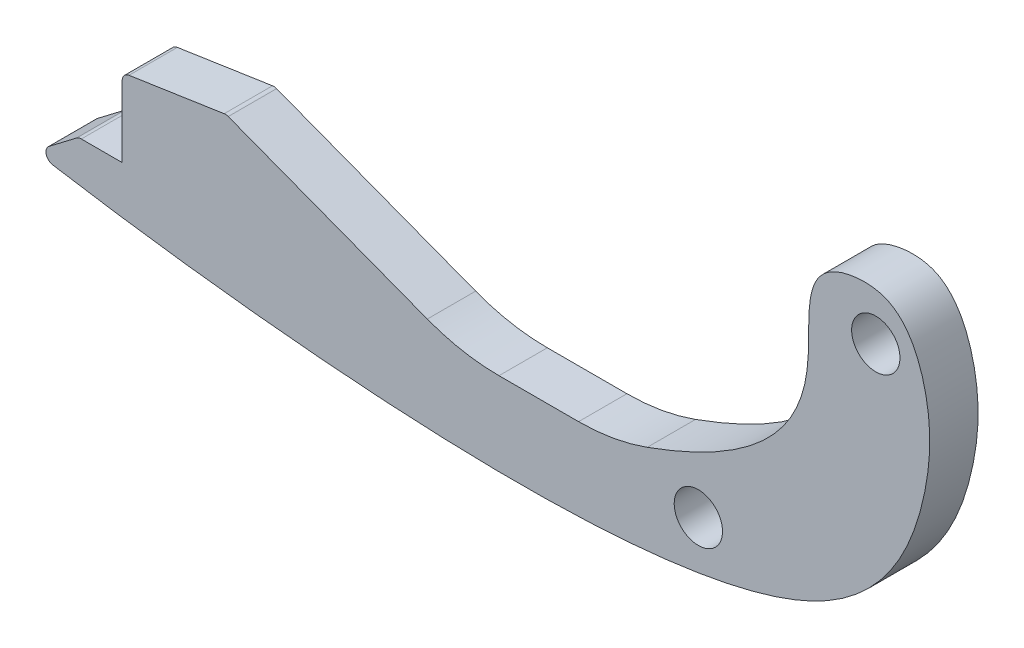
ISO-10303-21;
HEADER;
FILE_DESCRIPTION(('STEP AP214'),'2;1');
FILE_NAME('part.step','',(''),(''),'','','');
FILE_SCHEMA(('AUTOMOTIVE_DESIGN { 1 0 10303 214 1 1 1 1 }'));
ENDSEC;
DATA;
#1=APPLICATION_CONTEXT('core data for automotive mechanical design processes');
#2=APPLICATION_PROTOCOL_DEFINITION('international standard','automotive_design',2000,#1);
#3=PRODUCT_CONTEXT('',#1,'mechanical');
#4=PRODUCT('Part','Part','',(#3));
#5=PRODUCT_RELATED_PRODUCT_CATEGORY('part','',(#4));
#6=PRODUCT_DEFINITION_FORMATION('','',#4);
#7=PRODUCT_DEFINITION_CONTEXT('part definition',#1,'design');
#8=PRODUCT_DEFINITION('design','',#6,#7);
#9=PRODUCT_DEFINITION_SHAPE('','',#8);
#10=(LENGTH_UNIT() NAMED_UNIT(*) SI_UNIT(.MILLI.,.METRE.));
#11=(NAMED_UNIT(*) PLANE_ANGLE_UNIT() SI_UNIT($,.RADIAN.));
#12=(NAMED_UNIT(*) SI_UNIT($,.STERADIAN.) SOLID_ANGLE_UNIT());
#13=UNCERTAINTY_MEASURE_WITH_UNIT(LENGTH_MEASURE(1.E-05),#10,'distance_accuracy_value','');
#14=(GEOMETRIC_REPRESENTATION_CONTEXT(3) GLOBAL_UNCERTAINTY_ASSIGNED_CONTEXT((#13)) GLOBAL_UNIT_ASSIGNED_CONTEXT((#10,
#11,#12)) REPRESENTATION_CONTEXT('',''));
#15=CARTESIAN_POINT('',(0.,0.,0.));
#16=DIRECTION('',(0.,0.,1.));
#17=DIRECTION('',(1.,0.,0.));
#18=AXIS2_PLACEMENT_3D('',#15,#16,#17);
#19=CARTESIAN_POINT('',(22.6293093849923,18.4289926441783,3.048));
#20=DIRECTION('',(0.,0.,-1.));
#21=DIRECTION('',(-1.,0.,0.));
#22=AXIS2_PLACEMENT_3D('',#19,#20,#21);
#23=PLANE('',#22);
#24=CARTESIAN_POINT('',(20.2677876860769,27.5350231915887,3.048));
#25=DIRECTION('',(0.,0.,1.));
#26=DIRECTION('',(1.,0.,0.));
#27=AXIS2_PLACEMENT_3D('',#24,#25,#26);
#28=CIRCLE('',#27,1.524);
#29=CARTESIAN_POINT('',(18.7437876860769,27.5350231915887,3.048));
#30=VERTEX_POINT('',#29);
#31=EDGE_CURVE('E245',#30,#30,#28,.T.);
#32=ORIENTED_EDGE('',*,*,#31,.F.);
#33=EDGE_LOOP('',(#32));
#34=FACE_BOUND('',#33,.T.);
#35=DIRECTION('',(-1.,0.,0.));
#36=VECTOR('',#35,1.);
#37=CARTESIAN_POINT('',(-29.9965945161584,13.6816414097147,3.048));
#38=LINE('',#37,#36);
#39=CARTESIAN_POINT('',(-27.2482834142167,13.6816414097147,3.048));
#40=VERTEX_POINT('',#39);
#41=CARTESIAN_POINT('',(-29.8249537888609,13.6816414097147,3.048));
#42=VERTEX_POINT('',#41);
#43=EDGE_CURVE('E130',#40,#42,#38,.T.);
#44=ORIENTED_EDGE('',*,*,#43,.T.);
#45=CARTESIAN_POINT('',(-29.8249537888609,13.1736414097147,3.048));
#46=DIRECTION('',(0.,0.,-1.));
#47=DIRECTION('',(-1.,0.,0.));
#48=AXIS2_PLACEMENT_3D('',#45,#46,#47);
#49=CIRCLE('',#48,0.508);
#50=CARTESIAN_POINT('',(-30.1330617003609,13.5775393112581,3.048));
#51=VERTEX_POINT('',#50);
#52=EDGE_CURVE('E261',#42,#51,#49,.F.);
#53=ORIENTED_EDGE('',*,*,#52,.T.);
#54=DIRECTION('',(-0.795074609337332,-0.606511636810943,0.));
#55=VECTOR('',#54,1.);
#56=CARTESIAN_POINT('',(-32.7757503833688,11.5616009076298,3.048));
#57=LINE('',#56,#55);
#58=CARTESIAN_POINT('',(-31.8517395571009,12.2664697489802,3.048));
#59=VERTEX_POINT('',#58);
#60=EDGE_CURVE('E151',#51,#59,#57,.T.);
#61=ORIENTED_EDGE('',*,*,#60,.T.);
#62=CARTESIAN_POINT('',(-31.5436316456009,11.8625718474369,3.048));
#63=DIRECTION('',(0.,0.,-1.));
#64=DIRECTION('',(-1.,0.,0.));
#65=AXIS2_PLACEMENT_3D('',#62,#63,#64);
#66=CIRCLE('',#65,0.508);
#67=CARTESIAN_POINT('',(-31.6283933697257,11.3616931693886,3.048));
#68=VERTEX_POINT('',#67);
#69=EDGE_CURVE('E262',#59,#68,#66,.F.);
#70=ORIENTED_EDGE('',*,*,#69,.T.);
#71=CARTESIAN_POINT('',(-32.7757503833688,11.5616009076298,3.048));
#72=CARTESIAN_POINT('',(-25.7014626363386,10.2878145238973,3.048));
#73=CARTESIAN_POINT('',(15.6271652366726,4.09085473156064,3.048));
#74=CARTESIAN_POINT('',(23.4061715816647,18.7840539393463,3.048));
#75=CARTESIAN_POINT('',(23.9419978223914,25.9599764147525,3.048));
#76=CARTESIAN_POINT('',(21.9169974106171,30.8011403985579,3.048));
#77=CARTESIAN_POINT('',(15.308484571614,30.3570135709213,3.048));
#78=CARTESIAN_POINT('',(17.3819406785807,21.9915321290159,3.048));
#79=CARTESIAN_POINT('',(12.5367344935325,16.6791430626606,3.048));
#80=CARTESIAN_POINT('',(3.57592388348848,13.92379805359,3.048));
#81=B_SPLINE_CURVE_WITH_KNOTS('',3,(#71,#72,#73,#74,#75,#76,#77,#78,#79,#80),.UNSPECIFIED.,.F.,
.F.,(4,1,1,1,1,1,1,4),(0.,0.38975074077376,0.531750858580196,0.597670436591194,
0.657436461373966,0.68962853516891,0.80165392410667,1.),.UNSPECIFIED.);
#82=CARTESIAN_POINT('',(5.85357285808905,14.6829350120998,3.048));
#83=VERTEX_POINT('',#82);
#84=EDGE_CURVE('E146',#68,#83,#81,.T.);
#85=ORIENTED_EDGE('',*,*,#84,.T.);
#86=CARTESIAN_POINT('',(1.52855380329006,26.62379805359,3.048));
#87=DIRECTION('',(0.,0.,-1.));
#88=DIRECTION('',(-1.,0.,0.));
#89=AXIS2_PLACEMENT_3D('',#86,#87,#88);
#90=CIRCLE('',#89,12.7);
#91=CARTESIAN_POINT('',(1.52855380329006,13.92379805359,3.048));
#92=VERTEX_POINT('',#91);
#93=EDGE_CURVE('E309',#83,#92,#90,.T.);
#94=ORIENTED_EDGE('',*,*,#93,.T.);
#95=DIRECTION('',(-1.,0.,0.));
#96=VECTOR('',#95,1.);
#97=CARTESIAN_POINT('',(-5.82622704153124,13.92379805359,3.048));
#98=LINE('',#97,#96);
#99=CARTESIAN_POINT('',(-3.48886120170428,13.92379805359,3.048));
#100=VERTEX_POINT('',#99);
#101=EDGE_CURVE('E250',#92,#100,#98,.T.);
#102=ORIENTED_EDGE('',*,*,#101,.T.);
#103=CARTESIAN_POINT('',(-3.48886120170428,26.62379805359,3.048));
#104=DIRECTION('',(0.,0.,-1.));
#105=DIRECTION('',(-1.,0.,0.));
#106=AXIS2_PLACEMENT_3D('',#103,#104,#105);
#107=CIRCLE('',#106,12.7);
#108=CARTESIAN_POINT('',(-8.01043629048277,14.7559693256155,3.048));
#109=VERTEX_POINT('',#108);
#110=EDGE_CURVE('E306',#100,#109,#107,.T.);
#111=ORIENTED_EDGE('',*,*,#110,.T.);
#112=DIRECTION('',(-0.934474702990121,0.356029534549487,0.));
#113=VECTOR('',#112,1.);
#114=CARTESIAN_POINT('',(-20.6855257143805,19.5851061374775,3.048));
#115=LINE('',#114,#113);
#116=CARTESIAN_POINT('',(-20.5609374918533,19.537638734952,3.048));
#117=VERTEX_POINT('',#116);
#118=EDGE_CURVE('E253',#109,#117,#115,.T.);
#119=ORIENTED_EDGE('',*,*,#118,.T.);
#120=CARTESIAN_POINT('',(-20.7418004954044,19.062925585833,3.048));
#121=DIRECTION('',(0.,0.,-1.));
#122=DIRECTION('',(-1.,0.,0.));
#123=AXIS2_PLACEMENT_3D('',#120,#121,#122);
#124=CIRCLE('',#123,0.508);
#125=CARTESIAN_POINT('',(-20.8173667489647,19.5652738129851,3.048));
#126=VERTEX_POINT('',#125);
#127=EDGE_CURVE('E257',#117,#126,#124,.F.);
#128=ORIENTED_EDGE('',*,*,#127,.T.);
#129=DIRECTION('',(-0.988874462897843,-0.148752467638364,0.));
#130=VECTOR('',#129,1.);
#131=CARTESIAN_POINT('',(-27.2482834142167,18.5978964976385,3.048));
#132=LINE('',#131,#130);
#133=CARTESIAN_POINT('',(-26.815849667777,18.662945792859,3.048));
#134=VERTEX_POINT('',#133);
#135=EDGE_CURVE('E135',#126,#134,#132,.T.);
#136=ORIENTED_EDGE('',*,*,#135,.T.);
#137=CARTESIAN_POINT('',(-26.7402834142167,18.1605975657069,3.048));
#138=DIRECTION('',(0.,0.,-1.));
#139=DIRECTION('',(-1.,0.,0.));
#140=AXIS2_PLACEMENT_3D('',#137,#138,#139);
#141=CIRCLE('',#140,0.508);
#142=CARTESIAN_POINT('',(-27.2482834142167,18.1605975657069,3.048));
#143=VERTEX_POINT('',#142);
#144=EDGE_CURVE('E47',#134,#143,#141,.F.);
#145=ORIENTED_EDGE('',*,*,#144,.T.);
#146=DIRECTION('',(0.,-1.,0.));
#147=VECTOR('',#146,1.);
#148=CARTESIAN_POINT('',(-27.2482834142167,13.6816414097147,3.048));
#149=LINE('',#148,#147);
#150=EDGE_CURVE('E126',#143,#40,#149,.T.);
#151=ORIENTED_EDGE('',*,*,#150,.T.);
#152=EDGE_LOOP('',(#44,#53,#61,#70,#85,#94,#102,#111,#119,#128,#136,#145,#151));
#153=FACE_BOUND('',#152,.T.);
#154=CARTESIAN_POINT('',(9.08037325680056,12.4623363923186,3.048));
#155=DIRECTION('',(0.,0.,1.));
#156=DIRECTION('',(1.,0.,0.));
#157=AXIS2_PLACEMENT_3D('',#154,#155,#156);
#158=CIRCLE('',#157,1.524);
#159=CARTESIAN_POINT('',(7.55637325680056,12.4623363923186,3.048));
#160=VERTEX_POINT('',#159);
#161=EDGE_CURVE('E236',#160,#160,#158,.T.);
#162=ORIENTED_EDGE('',*,*,#161,.F.);
#163=EDGE_LOOP('',(#162));
#164=FACE_BOUND('',#163,.T.);
#165=ADVANCED_FACE('F32',(#34,#153,#164),#23,.F.);
#166=CARTESIAN_POINT('',(22.6293093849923,18.4289926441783,0.));
#167=DIRECTION('',(0.,0.,-1.));
#168=DIRECTION('',(-1.,0.,0.));
#169=AXIS2_PLACEMENT_3D('',#166,#167,#168);
#170=PLANE('',#169);
#171=CARTESIAN_POINT('',(20.2677876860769,27.5350231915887,0.));
#172=DIRECTION('',(0.,0.,1.));
#173=DIRECTION('',(1.,0.,0.));
#174=AXIS2_PLACEMENT_3D('',#171,#172,#173);
#175=CIRCLE('',#174,1.524);
#176=CARTESIAN_POINT('',(18.7437876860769,27.5350231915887,0.));
#177=VERTEX_POINT('',#176);
#178=EDGE_CURVE('E242',#177,#177,#175,.T.);
#179=ORIENTED_EDGE('',*,*,#178,.T.);
#180=EDGE_LOOP('',(#179));
#181=FACE_BOUND('',#180,.T.);
#182=DIRECTION('',(-0.795074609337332,-0.606511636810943,0.));
#183=VECTOR('',#182,1.);
#184=CARTESIAN_POINT('',(-32.7757503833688,11.5616009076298,0.));
#185=LINE('',#184,#183);
#186=CARTESIAN_POINT('',(-30.1330617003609,13.5775393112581,0.));
#187=VERTEX_POINT('',#186);
#188=CARTESIAN_POINT('',(-31.8517395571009,12.2664697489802,0.));
#189=VERTEX_POINT('',#188);
#190=EDGE_CURVE('E284',#187,#189,#185,.T.);
#191=ORIENTED_EDGE('',*,*,#190,.F.);
#192=CARTESIAN_POINT('',(-29.8249537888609,13.1736414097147,0.));
#193=DIRECTION('',(0.,0.,-1.));
#194=DIRECTION('',(-1.,0.,0.));
#195=AXIS2_PLACEMENT_3D('',#192,#193,#194);
#196=CIRCLE('',#195,0.508);
#197=CARTESIAN_POINT('',(-29.8249537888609,13.6816414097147,0.));
#198=VERTEX_POINT('',#197);
#199=EDGE_CURVE('E321',#187,#198,#196,.T.);
#200=ORIENTED_EDGE('',*,*,#199,.T.);
#201=DIRECTION('',(-1.,0.,0.));
#202=VECTOR('',#201,1.);
#203=CARTESIAN_POINT('',(-29.9965945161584,13.6816414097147,0.));
#204=LINE('',#203,#202);
#205=CARTESIAN_POINT('',(-27.2482834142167,13.6816414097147,0.));
#206=VERTEX_POINT('',#205);
#207=EDGE_CURVE('E286',#206,#198,#204,.T.);
#208=ORIENTED_EDGE('',*,*,#207,.F.);
#209=DIRECTION('',(0.,-1.,0.));
#210=VECTOR('',#209,1.);
#211=CARTESIAN_POINT('',(-27.2482834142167,13.6816414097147,0.));
#212=LINE('',#211,#210);
#213=CARTESIAN_POINT('',(-27.2482834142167,18.1605975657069,0.));
#214=VERTEX_POINT('',#213);
#215=EDGE_CURVE('E141',#214,#206,#212,.T.);
#216=ORIENTED_EDGE('',*,*,#215,.F.);
#217=CARTESIAN_POINT('',(-26.7402834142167,18.1605975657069,0.));
#218=DIRECTION('',(0.,0.,-1.));
#219=DIRECTION('',(-1.,0.,0.));
#220=AXIS2_PLACEMENT_3D('',#217,#218,#219);
#221=CIRCLE('',#220,0.508);
#222=CARTESIAN_POINT('',(-26.815849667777,18.662945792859,0.));
#223=VERTEX_POINT('',#222);
#224=EDGE_CURVE('E319',#214,#223,#221,.T.);
#225=ORIENTED_EDGE('',*,*,#224,.T.);
#226=DIRECTION('',(-0.988874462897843,-0.148752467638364,0.));
#227=VECTOR('',#226,1.);
#228=CARTESIAN_POINT('',(-27.2482834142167,18.5978964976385,0.));
#229=LINE('',#228,#227);
#230=CARTESIAN_POINT('',(-20.8173667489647,19.5652738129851,0.));
#231=VERTEX_POINT('',#230);
#232=EDGE_CURVE('E334',#231,#223,#229,.T.);
#233=ORIENTED_EDGE('',*,*,#232,.F.);
#234=CARTESIAN_POINT('',(-20.7418004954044,19.062925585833,0.));
#235=DIRECTION('',(0.,0.,-1.));
#236=DIRECTION('',(-1.,0.,0.));
#237=AXIS2_PLACEMENT_3D('',#234,#235,#236);
#238=CIRCLE('',#237,0.508);
#239=CARTESIAN_POINT('',(-20.5609374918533,19.537638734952,0.));
#240=VERTEX_POINT('',#239);
#241=EDGE_CURVE('E316',#231,#240,#238,.T.);
#242=ORIENTED_EDGE('',*,*,#241,.T.);
#243=DIRECTION('',(-0.934474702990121,0.356029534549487,0.));
#244=VECTOR('',#243,1.);
#245=CARTESIAN_POINT('',(-20.6855257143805,19.5851061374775,0.));
#246=LINE('',#245,#244);
#247=CARTESIAN_POINT('',(-8.01043629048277,14.7559693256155,0.));
#248=VERTEX_POINT('',#247);
#249=EDGE_CURVE('E332',#248,#240,#246,.T.);
#250=ORIENTED_EDGE('',*,*,#249,.F.);
#251=CARTESIAN_POINT('',(-3.48886120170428,26.62379805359,0.));
#252=DIRECTION('',(0.,0.,-1.));
#253=DIRECTION('',(-1.,0.,0.));
#254=AXIS2_PLACEMENT_3D('',#251,#252,#253);
#255=CIRCLE('',#254,12.7);
#256=CARTESIAN_POINT('',(-3.48886120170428,13.92379805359,0.));
#257=VERTEX_POINT('',#256);
#258=EDGE_CURVE('E304',#248,#257,#255,.F.);
#259=ORIENTED_EDGE('',*,*,#258,.T.);
#260=DIRECTION('',(-1.,0.,0.));
#261=VECTOR('',#260,1.);
#262=CARTESIAN_POINT('',(-5.82622704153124,13.92379805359,0.));
#263=LINE('',#262,#261);
#264=CARTESIAN_POINT('',(1.52855380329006,13.92379805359,0.));
#265=VERTEX_POINT('',#264);
#266=EDGE_CURVE('E161',#265,#257,#263,.T.);
#267=ORIENTED_EDGE('',*,*,#266,.F.);
#268=CARTESIAN_POINT('',(1.52855380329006,26.62379805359,0.));
#269=DIRECTION('',(0.,0.,-1.));
#270=DIRECTION('',(-1.,0.,0.));
#271=AXIS2_PLACEMENT_3D('',#268,#269,#270);
#272=CIRCLE('',#271,12.7);
#273=CARTESIAN_POINT('',(5.85357285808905,14.6829350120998,0.));
#274=VERTEX_POINT('',#273);
#275=EDGE_CURVE('E282',#265,#274,#272,.F.);
#276=ORIENTED_EDGE('',*,*,#275,.T.);
#277=CARTESIAN_POINT('',(-32.7757503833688,11.5616009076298,0.));
#278=CARTESIAN_POINT('',(-25.7014626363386,10.2878145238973,0.));
#279=CARTESIAN_POINT('',(15.6271652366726,4.09085473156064,0.));
#280=CARTESIAN_POINT('',(23.4061715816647,18.7840539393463,0.));
#281=CARTESIAN_POINT('',(23.9419978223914,25.9599764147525,0.));
#282=CARTESIAN_POINT('',(21.9169974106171,30.8011403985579,0.));
#283=CARTESIAN_POINT('',(15.308484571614,30.3570135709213,0.));
#284=CARTESIAN_POINT('',(17.3819406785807,21.9915321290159,0.));
#285=CARTESIAN_POINT('',(12.5367344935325,16.6791430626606,0.));
#286=CARTESIAN_POINT('',(3.57592388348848,13.92379805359,0.));
#287=B_SPLINE_CURVE_WITH_KNOTS('',3,(#277,#278,#279,#280,#281,#282,#283,#284,#285,#286),
.UNSPECIFIED.,.F.,.F.,(4,1,1,1,1,1,1,4),(0.,0.38975074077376,0.531750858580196,
0.597670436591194,0.657436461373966,0.68962853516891,0.80165392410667,1.),.UNSPECIFIED.);
#288=CARTESIAN_POINT('',(-31.6283933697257,11.3616931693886,0.));
#289=VERTEX_POINT('',#288);
#290=EDGE_CURVE('E254',#289,#274,#287,.T.);
#291=ORIENTED_EDGE('',*,*,#290,.F.);
#292=CARTESIAN_POINT('',(-31.5436316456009,11.8625718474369,0.));
#293=DIRECTION('',(0.,0.,-1.));
#294=DIRECTION('',(-1.,0.,0.));
#295=AXIS2_PLACEMENT_3D('',#292,#293,#294);
#296=CIRCLE('',#295,0.508);
#297=EDGE_CURVE('E279',#289,#189,#296,.T.);
#298=ORIENTED_EDGE('',*,*,#297,.T.);
#299=EDGE_LOOP('',(#191,#200,#208,#216,#225,#233,#242,#250,#259,#267,#276,#291,#298));
#300=FACE_BOUND('',#299,.T.);
#301=CARTESIAN_POINT('',(9.08037325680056,12.4623363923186,0.));
#302=DIRECTION('',(0.,0.,1.));
#303=DIRECTION('',(1.,0.,0.));
#304=AXIS2_PLACEMENT_3D('',#301,#302,#303);
#305=CIRCLE('',#304,1.524);
#306=CARTESIAN_POINT('',(7.55637325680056,12.4623363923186,0.));
#307=VERTEX_POINT('',#306);
#308=EDGE_CURVE('E239',#307,#307,#305,.T.);
#309=ORIENTED_EDGE('',*,*,#308,.T.);
#310=EDGE_LOOP('',(#309));
#311=FACE_BOUND('',#310,.T.);
#312=ADVANCED_FACE('F174',(#181,#300,#311),#170,.T.);
#313=CARTESIAN_POINT('',(-5.82622704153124,13.92379805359,3.048));
#314=DIRECTION('',(0.,-1.,0.));
#315=DIRECTION('',(0.,0.,-1.));
#316=AXIS2_PLACEMENT_3D('',#313,#314,#315);
#317=PLANE('',#316);
#318=ORIENTED_EDGE('',*,*,#266,.T.);
#319=DIRECTION('',(0.,0.,-1.));
#320=VECTOR('',#319,1.);
#321=CARTESIAN_POINT('',(-3.48886120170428,13.92379805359,3.048));
#322=LINE('',#321,#320);
#323=EDGE_CURVE('E300',#257,#100,#322,.F.);
#324=ORIENTED_EDGE('',*,*,#323,.T.);
#325=ORIENTED_EDGE('',*,*,#101,.F.);
#326=DIRECTION('',(0.,0.,1.));
#327=VECTOR('',#326,1.);
#328=CARTESIAN_POINT('',(1.52855380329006,13.92379805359,0.));
#329=LINE('',#328,#327);
#330=EDGE_CURVE('E297',#92,#265,#329,.F.);
#331=ORIENTED_EDGE('',*,*,#330,.T.);
#332=EDGE_LOOP('',(#318,#324,#325,#331));
#333=FACE_BOUND('',#332,.T.);
#334=ADVANCED_FACE('F189',(#333),#317,.F.);
#335=CARTESIAN_POINT('',(-20.6855257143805,19.5851061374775,3.048));
#336=DIRECTION('',(-0.356029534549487,-0.934474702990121,0.));
#337=DIRECTION('',(0.934474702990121,-0.356029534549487,0.));
#338=AXIS2_PLACEMENT_3D('',#335,#336,#337);
#339=PLANE('',#338);
#340=ORIENTED_EDGE('',*,*,#249,.T.);
#341=DIRECTION('',(0.,0.,-1.));
#342=VECTOR('',#341,1.);
#343=CARTESIAN_POINT('',(-20.5609374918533,19.537638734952,3.048));
#344=LINE('',#343,#342);
#345=EDGE_CURVE('E11',#240,#117,#344,.F.);
#346=ORIENTED_EDGE('',*,*,#345,.T.);
#347=ORIENTED_EDGE('',*,*,#118,.F.);
#348=DIRECTION('',(0.,0.,-1.));
#349=VECTOR('',#348,1.);
#350=CARTESIAN_POINT('',(-8.01043629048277,14.7559693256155,0.));
#351=LINE('',#350,#349);
#352=EDGE_CURVE('E145',#109,#248,#351,.T.);
#353=ORIENTED_EDGE('',*,*,#352,.T.);
#354=EDGE_LOOP('',(#340,#346,#347,#353));
#355=FACE_BOUND('',#354,.T.);
#356=ADVANCED_FACE('F186',(#355),#339,.F.);
#357=CARTESIAN_POINT('',(-27.2482834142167,18.5978964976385,3.048));
#358=DIRECTION('',(0.148752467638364,-0.988874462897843,0.));
#359=DIRECTION('',(0.988874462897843,0.148752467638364,0.));
#360=AXIS2_PLACEMENT_3D('',#357,#358,#359);
#361=PLANE('',#360);
#362=ORIENTED_EDGE('',*,*,#232,.T.);
#363=DIRECTION('',(0.,0.,-1.));
#364=VECTOR('',#363,1.);
#365=CARTESIAN_POINT('',(-26.815849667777,18.662945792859,3.048));
#366=LINE('',#365,#364);
#367=EDGE_CURVE('E55',#223,#134,#366,.F.);
#368=ORIENTED_EDGE('',*,*,#367,.T.);
#369=ORIENTED_EDGE('',*,*,#135,.F.);
#370=DIRECTION('',(0.,0.,-1.));
#371=VECTOR('',#370,1.);
#372=CARTESIAN_POINT('',(-20.8173667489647,19.5652738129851,3.048));
#373=LINE('',#372,#371);
#374=EDGE_CURVE('E269',#126,#231,#373,.T.);
#375=ORIENTED_EDGE('',*,*,#374,.T.);
#376=EDGE_LOOP('',(#362,#368,#369,#375));
#377=FACE_BOUND('',#376,.T.);
#378=ADVANCED_FACE('F183',(#377),#361,.F.);
#379=CARTESIAN_POINT('',(-27.2482834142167,13.6816414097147,3.048));
#380=DIRECTION('',(1.,0.,0.));
#381=DIRECTION('',(0.,0.,-1.));
#382=AXIS2_PLACEMENT_3D('',#379,#380,#381);
#383=PLANE('',#382);
#384=ORIENTED_EDGE('',*,*,#150,.F.);
#385=DIRECTION('',(0.,0.,-1.));
#386=VECTOR('',#385,1.);
#387=CARTESIAN_POINT('',(-27.2482834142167,18.1605975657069,3.048));
#388=LINE('',#387,#386);
#389=EDGE_CURVE('E260',#143,#214,#388,.T.);
#390=ORIENTED_EDGE('',*,*,#389,.T.);
#391=ORIENTED_EDGE('',*,*,#215,.T.);
#392=DIRECTION('',(0.,0.,-1.));
#393=VECTOR('',#392,1.);
#394=CARTESIAN_POINT('',(-27.2482834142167,13.6816414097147,3.048));
#395=LINE('',#394,#393);
#396=EDGE_CURVE('E138',#40,#206,#395,.T.);
#397=ORIENTED_EDGE('',*,*,#396,.F.);
#398=EDGE_LOOP('',(#384,#390,#391,#397));
#399=FACE_BOUND('',#398,.T.);
#400=ADVANCED_FACE('F139',(#399),#383,.F.);
#401=CARTESIAN_POINT('',(-29.9965945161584,13.6816414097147,3.048));
#402=DIRECTION('',(0.,-1.,0.));
#403=DIRECTION('',(0.,0.,-1.));
#404=AXIS2_PLACEMENT_3D('',#401,#402,#403);
#405=PLANE('',#404);
#406=ORIENTED_EDGE('',*,*,#207,.T.);
#407=DIRECTION('',(0.,0.,-1.));
#408=VECTOR('',#407,1.);
#409=CARTESIAN_POINT('',(-29.8249537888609,13.6816414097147,3.048));
#410=LINE('',#409,#408);
#411=EDGE_CURVE('E150',#198,#42,#410,.F.);
#412=ORIENTED_EDGE('',*,*,#411,.T.);
#413=ORIENTED_EDGE('',*,*,#43,.F.);
#414=ORIENTED_EDGE('',*,*,#396,.T.);
#415=EDGE_LOOP('',(#406,#412,#413,#414));
#416=FACE_BOUND('',#415,.T.);
#417=ADVANCED_FACE('F148',(#416),#405,.F.);
#418=CARTESIAN_POINT('',(-32.7757503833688,11.5616009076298,3.048));
#419=DIRECTION('',(0.606511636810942,-0.795074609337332,0.));
#420=DIRECTION('',(0.795074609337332,0.606511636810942,0.));
#421=AXIS2_PLACEMENT_3D('',#418,#419,#420);
#422=PLANE('',#421);
#423=ORIENTED_EDGE('',*,*,#60,.F.);
#424=DIRECTION('',(0.,0.,-1.));
#425=VECTOR('',#424,1.);
#426=CARTESIAN_POINT('',(-30.1330617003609,13.5775393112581,3.048));
#427=LINE('',#426,#425);
#428=EDGE_CURVE('E313',#51,#187,#427,.T.);
#429=ORIENTED_EDGE('',*,*,#428,.T.);
#430=ORIENTED_EDGE('',*,*,#190,.T.);
#431=DIRECTION('',(0.,0.,-1.));
#432=VECTOR('',#431,1.);
#433=CARTESIAN_POINT('',(-31.8517395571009,12.2664697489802,3.048));
#434=LINE('',#433,#432);
#435=EDGE_CURVE('E311',#189,#59,#434,.F.);
#436=ORIENTED_EDGE('',*,*,#435,.T.);
#437=EDGE_LOOP('',(#423,#429,#430,#436));
#438=FACE_BOUND('',#437,.T.);
#439=ADVANCED_FACE('F172',(#438),#422,.F.);
#440=DIRECTION('',(0.,0.,-1.));
#441=VECTOR('',#440,1.);
#442=SURFACE_OF_LINEAR_EXTRUSION('',#81,#441);
#443=ORIENTED_EDGE('',*,*,#84,.F.);
#444=DIRECTION('',(0.,0.,-1.));
#445=VECTOR('',#444,1.);
#446=CARTESIAN_POINT('',(-31.6283933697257,11.3616931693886,3.048));
#447=LINE('',#446,#445);
#448=EDGE_CURVE('E40',#68,#289,#447,.T.);
#449=ORIENTED_EDGE('',*,*,#448,.T.);
#450=ORIENTED_EDGE('',*,*,#290,.T.);
#451=DIRECTION('',(0.,0.,-1.));
#452=VECTOR('',#451,1.);
#453=CARTESIAN_POINT('',(5.85357285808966,14.6829350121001,0.));
#454=LINE('',#453,#452);
#455=EDGE_CURVE('E302',#274,#83,#454,.F.);
#456=ORIENTED_EDGE('',*,*,#455,.T.);
#457=EDGE_LOOP('',(#443,#449,#450,#456));
#458=FACE_BOUND('',#457,.T.);
#459=ADVANCED_FACE('F167',(#458),#442,.F.);
#460=CARTESIAN_POINT('',(20.2677876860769,27.5350231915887,3.048));
#461=DIRECTION('',(0.,0.,-1.));
#462=DIRECTION('',(-1.,0.,0.));
#463=AXIS2_PLACEMENT_3D('',#460,#461,#462);
#464=CYLINDRICAL_SURFACE('',#463,1.524);
#465=CARTESIAN_POINT('',(18.7437876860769,27.5350231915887,3.048));
#466=CARTESIAN_POINT('',(18.7437876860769,27.5350231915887,3.01625));
#467=CARTESIAN_POINT('',(18.7437876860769,27.5350231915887,2.9845));
#468=CARTESIAN_POINT('',(18.7437876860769,27.5350231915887,2.921));
#469=CARTESIAN_POINT('',(18.7437876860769,27.5350231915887,2.88925));
#470=CARTESIAN_POINT('',(18.7437876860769,27.5350231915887,2.82575));
#471=CARTESIAN_POINT('',(18.7437876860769,27.5350231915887,2.794));
#472=CARTESIAN_POINT('',(18.7437876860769,27.5350231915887,2.7305));
#473=CARTESIAN_POINT('',(18.7437876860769,27.5350231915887,2.69875));
#474=CARTESIAN_POINT('',(18.7437876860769,27.5350231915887,2.63525));
#475=CARTESIAN_POINT('',(18.7437876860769,27.5350231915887,2.6035));
#476=CARTESIAN_POINT('',(18.7437876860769,27.5350231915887,2.54));
#477=CARTESIAN_POINT('',(18.7437876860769,27.5350231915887,2.50825));
#478=CARTESIAN_POINT('',(18.7437876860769,27.5350231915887,2.44475));
#479=CARTESIAN_POINT('',(18.7437876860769,27.5350231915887,2.413));
#480=CARTESIAN_POINT('',(18.7437876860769,27.5350231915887,2.3495));
#481=CARTESIAN_POINT('',(18.7437876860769,27.5350231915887,2.31775));
#482=CARTESIAN_POINT('',(18.7437876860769,27.5350231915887,2.25425));
#483=CARTESIAN_POINT('',(18.7437876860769,27.5350231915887,2.2225));
#484=CARTESIAN_POINT('',(18.7437876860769,27.5350231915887,2.159));
#485=CARTESIAN_POINT('',(18.7437876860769,27.5350231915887,2.12725));
#486=CARTESIAN_POINT('',(18.7437876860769,27.5350231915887,2.06375));
#487=CARTESIAN_POINT('',(18.7437876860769,27.5350231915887,2.032));
#488=CARTESIAN_POINT('',(18.7437876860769,27.5350231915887,1.9685));
#489=CARTESIAN_POINT('',(18.7437876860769,27.5350231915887,1.93675));
#490=CARTESIAN_POINT('',(18.7437876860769,27.5350231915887,1.87325));
#491=CARTESIAN_POINT('',(18.7437876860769,27.5350231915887,1.8415));
#492=CARTESIAN_POINT('',(18.7437876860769,27.5350231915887,1.778));
#493=CARTESIAN_POINT('',(18.7437876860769,27.5350231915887,1.74625));
#494=CARTESIAN_POINT('',(18.7437876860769,27.5350231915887,1.68275));
#495=CARTESIAN_POINT('',(18.7437876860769,27.5350231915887,1.651));
#496=CARTESIAN_POINT('',(18.7437876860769,27.5350231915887,1.5875));
#497=CARTESIAN_POINT('',(18.7437876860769,27.5350231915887,1.55575));
#498=CARTESIAN_POINT('',(18.7437876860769,27.5350231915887,1.49225));
#499=CARTESIAN_POINT('',(18.7437876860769,27.5350231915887,1.4605));
#500=CARTESIAN_POINT('',(18.7437876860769,27.5350231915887,1.397));
#501=CARTESIAN_POINT('',(18.7437876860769,27.5350231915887,1.36525));
#502=CARTESIAN_POINT('',(18.7437876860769,27.5350231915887,1.30175));
#503=CARTESIAN_POINT('',(18.7437876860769,27.5350231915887,1.27));
#504=CARTESIAN_POINT('',(18.7437876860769,27.5350231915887,1.2065));
#505=CARTESIAN_POINT('',(18.7437876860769,27.5350231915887,1.17475));
#506=CARTESIAN_POINT('',(18.7437876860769,27.5350231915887,1.11125));
#507=CARTESIAN_POINT('',(18.7437876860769,27.5350231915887,1.0795));
#508=CARTESIAN_POINT('',(18.7437876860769,27.5350231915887,1.016));
#509=CARTESIAN_POINT('',(18.7437876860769,27.5350231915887,0.98425));
#510=CARTESIAN_POINT('',(18.7437876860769,27.5350231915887,0.92075));
#511=CARTESIAN_POINT('',(18.7437876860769,27.5350231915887,0.889));
#512=CARTESIAN_POINT('',(18.7437876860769,27.5350231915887,0.8255));
#513=CARTESIAN_POINT('',(18.7437876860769,27.5350231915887,0.79375));
#514=CARTESIAN_POINT('',(18.7437876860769,27.5350231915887,0.73025));
#515=CARTESIAN_POINT('',(18.7437876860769,27.5350231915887,0.6985));
#516=CARTESIAN_POINT('',(18.7437876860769,27.5350231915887,0.635));
#517=CARTESIAN_POINT('',(18.7437876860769,27.5350231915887,0.60325));
#518=CARTESIAN_POINT('',(18.7437876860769,27.5350231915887,0.53975));
#519=CARTESIAN_POINT('',(18.7437876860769,27.5350231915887,0.508));
#520=CARTESIAN_POINT('',(18.7437876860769,27.5350231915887,0.4445));
#521=CARTESIAN_POINT('',(18.7437876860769,27.5350231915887,0.41275));
#522=CARTESIAN_POINT('',(18.7437876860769,27.5350231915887,0.34925));
#523=CARTESIAN_POINT('',(18.7437876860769,27.5350231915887,0.3175));
#524=CARTESIAN_POINT('',(18.7437876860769,27.5350231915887,0.254));
#525=CARTESIAN_POINT('',(18.7437876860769,27.5350231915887,0.22225));
#526=CARTESIAN_POINT('',(18.7437876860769,27.5350231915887,0.15875));
#527=CARTESIAN_POINT('',(18.7437876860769,27.5350231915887,0.127));
#528=CARTESIAN_POINT('',(18.7437876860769,27.5350231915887,0.0634999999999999));
#529=CARTESIAN_POINT('',(18.7437876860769,27.5350231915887,0.03175));
#530=CARTESIAN_POINT('',(18.7437876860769,27.5350231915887,0.));
#531=B_SPLINE_CURVE_WITH_KNOTS('',3,(#465,#466,#467,#468,#469,#470,#471,#472,#473,#474,#475,
#476,#477,#478,#479,#480,#481,#482,#483,#484,#485,#486,#487,#488,#489,#490,#491,#492,#493,#494,
#495,#496,#497,#498,#499,#500,#501,#502,#503,#504,#505,#506,#507,#508,#509,#510,#511,#512,#513,
#514,#515,#516,#517,#518,#519,#520,#521,#522,#523,#524,#525,#526,#527,#528,#529,#530),
.UNSPECIFIED.,.F.,.F.,(4,2,2,2,2,2,2,2,2,2,2,2,2,2,2,2,2,2,2,2,2,2,2,2,2,2,2,2,2,2,2,2,4),(0.,
0.0952499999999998,0.1905,0.28575,0.381,0.47625,0.5715,0.66675,0.762,0.85725,0.9525,1.04775,
1.143,1.23825,1.3335,1.42875,1.524,1.61925,1.7145,1.80975,1.905,2.00025,2.0955,2.19075,2.286,
2.38125,2.4765,2.57175,2.667,2.76225,2.8575,2.95275,3.048),.UNSPECIFIED.);
#532=EDGE_CURVE('BSEAM171',#30,#177,#531,.T.);
#533=ORIENTED_EDGE('',*,*,#31,.T.);
#534=ORIENTED_EDGE('',*,*,#178,.F.);
#535=ORIENTED_EDGE('',*,*,#532,.T.);
#536=ORIENTED_EDGE('',*,*,#532,.F.);
#537=EDGE_LOOP('',(#533,#535,#534,#536));
#538=FACE_BOUND('',#537,.T.);
#539=ADVANCED_FACE('F171',(#538),#464,.F.);
#540=CARTESIAN_POINT('',(9.08037325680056,12.4623363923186,3.048));
#541=DIRECTION('',(0.,0.,-1.));
#542=DIRECTION('',(-1.,0.,0.));
#543=AXIS2_PLACEMENT_3D('',#540,#541,#542);
#544=CYLINDRICAL_SURFACE('',#543,1.524);
#545=CARTESIAN_POINT('',(7.55637325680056,12.4623363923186,3.048));
#546=CARTESIAN_POINT('',(7.55637325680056,12.4623363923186,3.01625));
#547=CARTESIAN_POINT('',(7.55637325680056,12.4623363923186,2.9845));
#548=CARTESIAN_POINT('',(7.55637325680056,12.4623363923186,2.921));
#549=CARTESIAN_POINT('',(7.55637325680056,12.4623363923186,2.88925));
#550=CARTESIAN_POINT('',(7.55637325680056,12.4623363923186,2.82575));
#551=CARTESIAN_POINT('',(7.55637325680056,12.4623363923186,2.794));
#552=CARTESIAN_POINT('',(7.55637325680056,12.4623363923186,2.7305));
#553=CARTESIAN_POINT('',(7.55637325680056,12.4623363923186,2.69875));
#554=CARTESIAN_POINT('',(7.55637325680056,12.4623363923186,2.63525));
#555=CARTESIAN_POINT('',(7.55637325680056,12.4623363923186,2.6035));
#556=CARTESIAN_POINT('',(7.55637325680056,12.4623363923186,2.54));
#557=CARTESIAN_POINT('',(7.55637325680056,12.4623363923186,2.50825));
#558=CARTESIAN_POINT('',(7.55637325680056,12.4623363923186,2.44475));
#559=CARTESIAN_POINT('',(7.55637325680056,12.4623363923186,2.413));
#560=CARTESIAN_POINT('',(7.55637325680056,12.4623363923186,2.3495));
#561=CARTESIAN_POINT('',(7.55637325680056,12.4623363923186,2.31775));
#562=CARTESIAN_POINT('',(7.55637325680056,12.4623363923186,2.25425));
#563=CARTESIAN_POINT('',(7.55637325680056,12.4623363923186,2.2225));
#564=CARTESIAN_POINT('',(7.55637325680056,12.4623363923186,2.159));
#565=CARTESIAN_POINT('',(7.55637325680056,12.4623363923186,2.12725));
#566=CARTESIAN_POINT('',(7.55637325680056,12.4623363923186,2.06375));
#567=CARTESIAN_POINT('',(7.55637325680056,12.4623363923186,2.032));
#568=CARTESIAN_POINT('',(7.55637325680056,12.4623363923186,1.9685));
#569=CARTESIAN_POINT('',(7.55637325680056,12.4623363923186,1.93675));
#570=CARTESIAN_POINT('',(7.55637325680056,12.4623363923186,1.87325));
#571=CARTESIAN_POINT('',(7.55637325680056,12.4623363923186,1.8415));
#572=CARTESIAN_POINT('',(7.55637325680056,12.4623363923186,1.778));
#573=CARTESIAN_POINT('',(7.55637325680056,12.4623363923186,1.74625));
#574=CARTESIAN_POINT('',(7.55637325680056,12.4623363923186,1.68275));
#575=CARTESIAN_POINT('',(7.55637325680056,12.4623363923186,1.651));
#576=CARTESIAN_POINT('',(7.55637325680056,12.4623363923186,1.5875));
#577=CARTESIAN_POINT('',(7.55637325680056,12.4623363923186,1.55575));
#578=CARTESIAN_POINT('',(7.55637325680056,12.4623363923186,1.49225));
#579=CARTESIAN_POINT('',(7.55637325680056,12.4623363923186,1.4605));
#580=CARTESIAN_POINT('',(7.55637325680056,12.4623363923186,1.397));
#581=CARTESIAN_POINT('',(7.55637325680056,12.4623363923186,1.36525));
#582=CARTESIAN_POINT('',(7.55637325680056,12.4623363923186,1.30175));
#583=CARTESIAN_POINT('',(7.55637325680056,12.4623363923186,1.27));
#584=CARTESIAN_POINT('',(7.55637325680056,12.4623363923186,1.2065));
#585=CARTESIAN_POINT('',(7.55637325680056,12.4623363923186,1.17475));
#586=CARTESIAN_POINT('',(7.55637325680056,12.4623363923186,1.11125));
#587=CARTESIAN_POINT('',(7.55637325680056,12.4623363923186,1.0795));
#588=CARTESIAN_POINT('',(7.55637325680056,12.4623363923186,1.016));
#589=CARTESIAN_POINT('',(7.55637325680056,12.4623363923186,0.98425));
#590=CARTESIAN_POINT('',(7.55637325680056,12.4623363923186,0.92075));
#591=CARTESIAN_POINT('',(7.55637325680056,12.4623363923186,0.889));
#592=CARTESIAN_POINT('',(7.55637325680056,12.4623363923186,0.8255));
#593=CARTESIAN_POINT('',(7.55637325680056,12.4623363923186,0.79375));
#594=CARTESIAN_POINT('',(7.55637325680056,12.4623363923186,0.73025));
#595=CARTESIAN_POINT('',(7.55637325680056,12.4623363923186,0.6985));
#596=CARTESIAN_POINT('',(7.55637325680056,12.4623363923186,0.635));
#597=CARTESIAN_POINT('',(7.55637325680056,12.4623363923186,0.60325));
#598=CARTESIAN_POINT('',(7.55637325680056,12.4623363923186,0.53975));
#599=CARTESIAN_POINT('',(7.55637325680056,12.4623363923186,0.508));
#600=CARTESIAN_POINT('',(7.55637325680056,12.4623363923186,0.4445));
#601=CARTESIAN_POINT('',(7.55637325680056,12.4623363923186,0.41275));
#602=CARTESIAN_POINT('',(7.55637325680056,12.4623363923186,0.34925));
#603=CARTESIAN_POINT('',(7.55637325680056,12.4623363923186,0.3175));
#604=CARTESIAN_POINT('',(7.55637325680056,12.4623363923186,0.254));
#605=CARTESIAN_POINT('',(7.55637325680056,12.4623363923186,0.22225));
#606=CARTESIAN_POINT('',(7.55637325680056,12.4623363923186,0.15875));
#607=CARTESIAN_POINT('',(7.55637325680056,12.4623363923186,0.127));
#608=CARTESIAN_POINT('',(7.55637325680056,12.4623363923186,0.0634999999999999));
#609=CARTESIAN_POINT('',(7.55637325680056,12.4623363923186,0.03175));
#610=CARTESIAN_POINT('',(7.55637325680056,12.4623363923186,0.));
#611=B_SPLINE_CURVE_WITH_KNOTS('',3,(#545,#546,#547,#548,#549,#550,#551,#552,#553,#554,#555,
#556,#557,#558,#559,#560,#561,#562,#563,#564,#565,#566,#567,#568,#569,#570,#571,#572,#573,#574,
#575,#576,#577,#578,#579,#580,#581,#582,#583,#584,#585,#586,#587,#588,#589,#590,#591,#592,#593,
#594,#595,#596,#597,#598,#599,#600,#601,#602,#603,#604,#605,#606,#607,#608,#609,#610),
.UNSPECIFIED.,.F.,.F.,(4,2,2,2,2,2,2,2,2,2,2,2,2,2,2,2,2,2,2,2,2,2,2,2,2,2,2,2,2,2,2,2,4),(0.,
0.0952499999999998,0.1905,0.28575,0.381,0.47625,0.5715,0.66675,0.762,0.85725,0.9525,1.04775,
1.143,1.23825,1.3335,1.42875,1.524,1.61925,1.7145,1.80975,1.905,2.00025,2.0955,2.19075,2.286,
2.38125,2.4765,2.57175,2.667,2.76225,2.8575,2.95275,3.048),.UNSPECIFIED.);
#612=EDGE_CURVE('BSEAM198',#160,#307,#611,.T.);
#613=ORIENTED_EDGE('',*,*,#161,.T.);
#614=ORIENTED_EDGE('',*,*,#308,.F.);
#615=ORIENTED_EDGE('',*,*,#612,.T.);
#616=ORIENTED_EDGE('',*,*,#612,.F.);
#617=EDGE_LOOP('',(#613,#615,#614,#616));
#618=FACE_BOUND('',#617,.T.);
#619=ADVANCED_FACE('F198',(#618),#544,.F.);
#620=CARTESIAN_POINT('',(-3.48886120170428,26.62379805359,3.048));
#621=DIRECTION('',(0.,0.,1.));
#622=DIRECTION('',(1.,0.,0.));
#623=AXIS2_PLACEMENT_3D('',#620,#621,#622);
#624=CYLINDRICAL_SURFACE('',#623,12.7);
#625=ORIENTED_EDGE('',*,*,#110,.F.);
#626=ORIENTED_EDGE('',*,*,#323,.F.);
#627=ORIENTED_EDGE('',*,*,#258,.F.);
#628=ORIENTED_EDGE('',*,*,#352,.F.);
#629=EDGE_LOOP('',(#625,#626,#627,#628));
#630=FACE_BOUND('',#629,.T.);
#631=ADVANCED_FACE('F194',(#630),#624,.F.);
#632=CARTESIAN_POINT('',(1.52855380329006,26.62379805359,1.524));
#633=DIRECTION('',(0.,0.,-1.));
#634=DIRECTION('',(-1.,0.,0.));
#635=AXIS2_PLACEMENT_3D('',#632,#633,#634);
#636=CYLINDRICAL_SURFACE('',#635,12.7);
#637=ORIENTED_EDGE('',*,*,#93,.F.);
#638=ORIENTED_EDGE('',*,*,#455,.F.);
#639=ORIENTED_EDGE('',*,*,#275,.F.);
#640=ORIENTED_EDGE('',*,*,#330,.F.);
#641=EDGE_LOOP('',(#637,#638,#639,#640));
#642=FACE_BOUND('',#641,.T.);
#643=ADVANCED_FACE('F197',(#642),#636,.F.);
#644=CARTESIAN_POINT('',(-29.8249537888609,13.1736414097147,3.048));
#645=DIRECTION('',(0.,0.,-1.));
#646=DIRECTION('',(-1.,0.,0.));
#647=AXIS2_PLACEMENT_3D('',#644,#645,#646);
#648=CYLINDRICAL_SURFACE('',#647,0.508);
#649=ORIENTED_EDGE('',*,*,#52,.F.);
#650=ORIENTED_EDGE('',*,*,#411,.F.);
#651=ORIENTED_EDGE('',*,*,#199,.F.);
#652=ORIENTED_EDGE('',*,*,#428,.F.);
#653=EDGE_LOOP('',(#649,#650,#651,#652));
#654=FACE_BOUND('',#653,.T.);
#655=ADVANCED_FACE('F202',(#654),#648,.T.);
#656=CARTESIAN_POINT('',(-26.7402834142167,18.1605975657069,3.048));
#657=DIRECTION('',(0.,0.,-1.));
#658=DIRECTION('',(-1.,0.,0.));
#659=AXIS2_PLACEMENT_3D('',#656,#657,#658);
#660=CYLINDRICAL_SURFACE('',#659,0.508);
#661=ORIENTED_EDGE('',*,*,#144,.F.);
#662=ORIENTED_EDGE('',*,*,#367,.F.);
#663=ORIENTED_EDGE('',*,*,#224,.F.);
#664=ORIENTED_EDGE('',*,*,#389,.F.);
#665=EDGE_LOOP('',(#661,#662,#663,#664));
#666=FACE_BOUND('',#665,.T.);
#667=ADVANCED_FACE('F206',(#666),#660,.T.);
#668=CARTESIAN_POINT('',(-31.5436316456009,11.8625718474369,1.524));
#669=DIRECTION('',(0.,0.,-1.));
#670=DIRECTION('',(-1.,0.,0.));
#671=AXIS2_PLACEMENT_3D('',#668,#669,#670);
#672=CYLINDRICAL_SURFACE('',#671,0.508);
#673=ORIENTED_EDGE('',*,*,#69,.F.);
#674=ORIENTED_EDGE('',*,*,#435,.F.);
#675=ORIENTED_EDGE('',*,*,#297,.F.);
#676=ORIENTED_EDGE('',*,*,#448,.F.);
#677=EDGE_LOOP('',(#673,#674,#675,#676));
#678=FACE_BOUND('',#677,.T.);
#679=ADVANCED_FACE('F209',(#678),#672,.T.);
#680=CARTESIAN_POINT('',(-20.7418004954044,19.062925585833,3.048));
#681=DIRECTION('',(0.,0.,-1.));
#682=DIRECTION('',(-1.,0.,0.));
#683=AXIS2_PLACEMENT_3D('',#680,#681,#682);
#684=CYLINDRICAL_SURFACE('',#683,0.508);
#685=ORIENTED_EDGE('',*,*,#127,.F.);
#686=ORIENTED_EDGE('',*,*,#345,.F.);
#687=ORIENTED_EDGE('',*,*,#241,.F.);
#688=ORIENTED_EDGE('',*,*,#374,.F.);
#689=EDGE_LOOP('',(#685,#686,#687,#688));
#690=FACE_BOUND('',#689,.T.);
#691=ADVANCED_FACE('F34',(#690),#684,.T.);
#692=CLOSED_SHELL('',(#165,#312,#334,#356,#378,#400,#417,#439,#459,#539,#619,#631,#643,#655,
#667,#679,#691));
#693=MANIFOLD_SOLID_BREP('B2',#692);
#694=ADVANCED_BREP_SHAPE_REPRESENTATION('',(#18,#693),#14);
#695=SHAPE_DEFINITION_REPRESENTATION(#9,#694);
ENDSEC;
END-ISO-10303-21;
